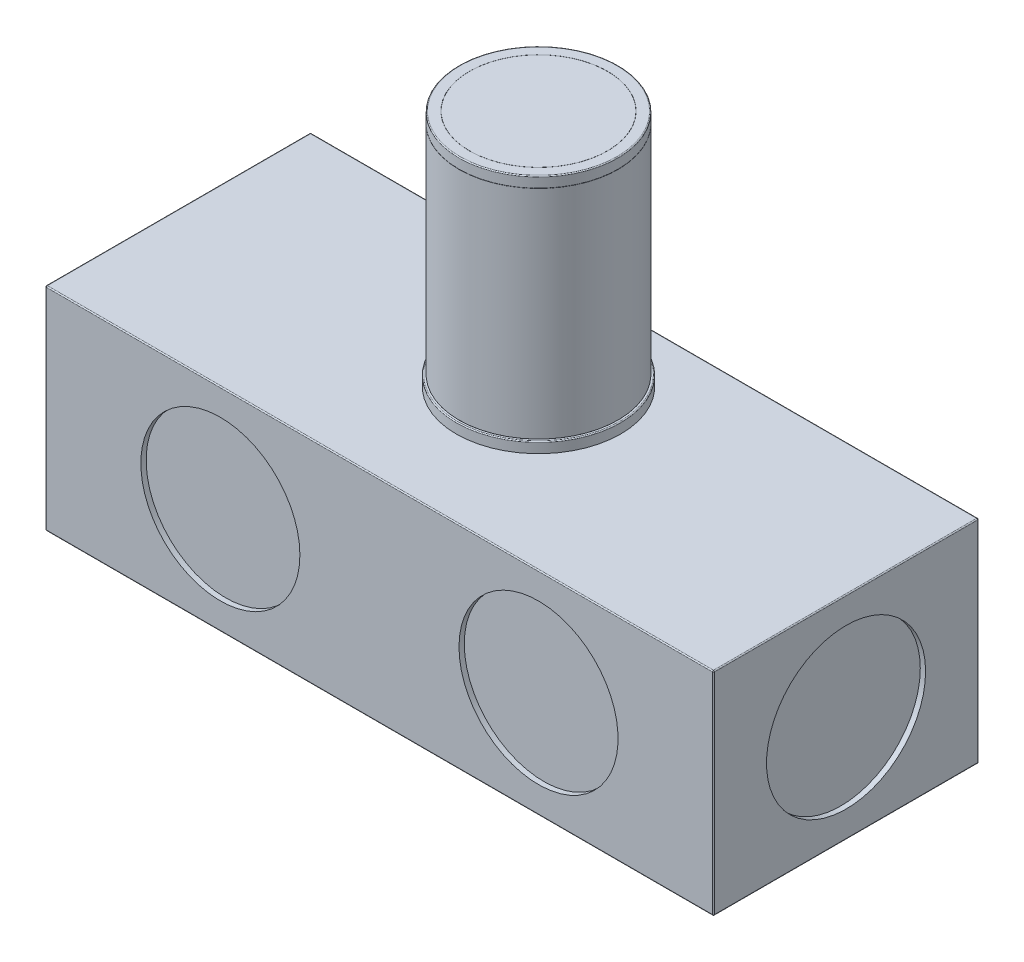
from build123d import *

# Parameters (mm, degrees)
SKETCH1_W           = 63
SKETCH1_H           = 20
BOSS_EXTRUDE1_DEPTH = 25
SKETCH2_R           = 7.5
CUT_EXTRUDE1_DEPTH  = 0.5
CUT_EXTRUDE2_START  = -0.5
SKETCH3_R           = 7.5
CUT_EXTRUDE2_DEPTH  = 0.5
BOSS_EXTRUDE3_DEPTH = 6.5
FILLET2_R           = 0.1
SKETCH8_R           = 7.5
CUT_EXTRUDE3_DEPTH  = 0.5


with BuildPart() as part:
    # Sketch1 → Boss-Extrude1 (new body)
    with BuildSketch(Plane.XY):
        with Locations((0, 10)):
            Rectangle(SKETCH1_W, SKETCH1_H)
    extrude(amount=BOSS_EXTRUDE1_DEPTH)

    # Sketch2 → Cut-Extrude1 (cut)
    with BuildSketch(Plane(origin=(31.5, 0, 0), x_dir=(0, 0, -1), z_dir=(1, 0, 0))):
        with Locations((-12.5, 10)):
            Circle(SKETCH2_R)
    extrude(amount=-CUT_EXTRUDE1_DEPTH, mode=Mode.SUBTRACT)

    # Sketch3 → Cut-Extrude2 (cut)
    with BuildSketch(Plane.ZY.offset(31.5).offset(CUT_EXTRUDE2_START)):
        with Locations(Location((12.5, 10, 0), (0, 0, 180))):
            Circle(SKETCH3_R)
    extrude(amount=CUT_EXTRUDE2_DEPTH, mode=Mode.SUBTRACT)

    # Sketch4 → Revolve2 (revolve)
    with BuildSketch(Plane(origin=(0, 0, 0), x_dir=(0, 0, -1), z_dir=(1, 0, 0))):
        with BuildLine():
            Line((-17.5, 21.019), (-17.5, 41.481))
            ThreePointArc((-17.5, 41.481), (-17.497363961, 41.487363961), (-17.491, 41.49))
            Line((-17.491, 41.49), (-17.49, 41.5))
            Line((-17.49, 41.5), (-17.491, 41.5))
            ThreePointArc((-17.491, 41.5), (-17.497363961, 41.502636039), (-17.5, 41.509))
            Line((-17.5, 41.509), (-17.5, 42.41))
            ThreePointArc((-17.5, 42.41), (-17.47363961, 42.47363961), (-17.41, 42.5))
            Line((-17.41, 42.5), (-16.51, 42.5))
            Line((-16.51, 42.5), (-16.51, 42.4))
            Line((-16.51, 42.4), (-16.5, 42.4))
            Line((-16.5, 42.4), (-16.5, 42.5))
            Line((-16.5, 42.5), (-10, 42.5))
            Line((-10, 42.5), (-10, -0.9))
            Line((-10, -0.9), (-10, -1))
            Line((-10, -1), (-14.75, -1))
            Line((-14.75, -1), (-14.75, -0.9))
            Line((-14.75, -0.9), (-17.66, -0.9))
            ThreePointArc((-17.66, -0.9), (-17.72363961, -0.87363961), (-17.75, -0.81))
            Line((-17.75, -0.81), (-17.75, 20.91))
            ThreePointArc((-17.75, 20.91), (-17.72363961, 20.97363961), (-17.66, 21))
            Line((-17.66, 21), (-17.4, 21))
            Line((-17.4, 21), (-17.4, 21.01))
            Line((-17.4, 21.01), (-17.491, 21.01))
            ThreePointArc((-17.491, 21.01), (-17.497363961, 21.012636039), (-17.5, 21.019))
        make_face()
    revolve(axis=Axis((0, 42.5, 10), (0, -1, 0)))

    # Sketch6 → Boss-Extrude3 (add)
    with BuildSketch(Plane.XZ.offset(1)):
        Polygon((0, 17.794228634), (-6.75, 13.897114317), (-6.75, 6.102885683), (0, 2.205771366), (6.75, 6.102885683), (6.75, 13.897114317), align=None)
    extrude(amount=BOSS_EXTRUDE3_DEPTH)

    # Sketch7 → Cut-Revolve1 (revolve, cut)
    with BuildSketch(Plane(origin=(0, 0, 0), x_dir=(0, 0, -1), z_dir=(1, 0, 0))):
        Polygon((-18.024228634, -6.72), (-16.638350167, -7.62), (-18.024228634, -7.62), align=None)
        Polygon((-18.024228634, -1.78), (-18.024228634, -0.924068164), (-16.707787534, -0.924068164), align=None)
    revolve(axis=Axis((0, -1, 10), (0, -1, 0)), mode=Mode.SUBTRACT)

    # Fillet2
    fillet2_edges = [part.edges().sort_by_distance(p)[0] for p in [
        (31.5, 10, 25),
        (0, 20, 25),
        (-31.5, 10, 25),
        (0, 20, 0),
        (31.5, 10, 0),
        (0, 0, 0),
        (-31.5, 10, 0),
        (0, 0, 25),
        (-31.5, 20, 12.5),
        (31.5, 20, 12.5),
        (31.5, 0, 12.5),
        (-31.5, 0, 12.5),
    ]]
    fillet(fillet2_edges, radius=FILLET2_R)

    # Sketch8 → Cut-Extrude3 (cut)
    with BuildSketch(Plane.XY.offset(25)):
        with Locations((-15, 10)):
            Circle(SKETCH8_R)
        with Locations(Location((15, 10, 0), (0, 0, 180))):
            Circle(SKETCH8_R)
    extrude(amount=-CUT_EXTRUDE3_DEPTH, mode=Mode.SUBTRACT)


solid = part.part
